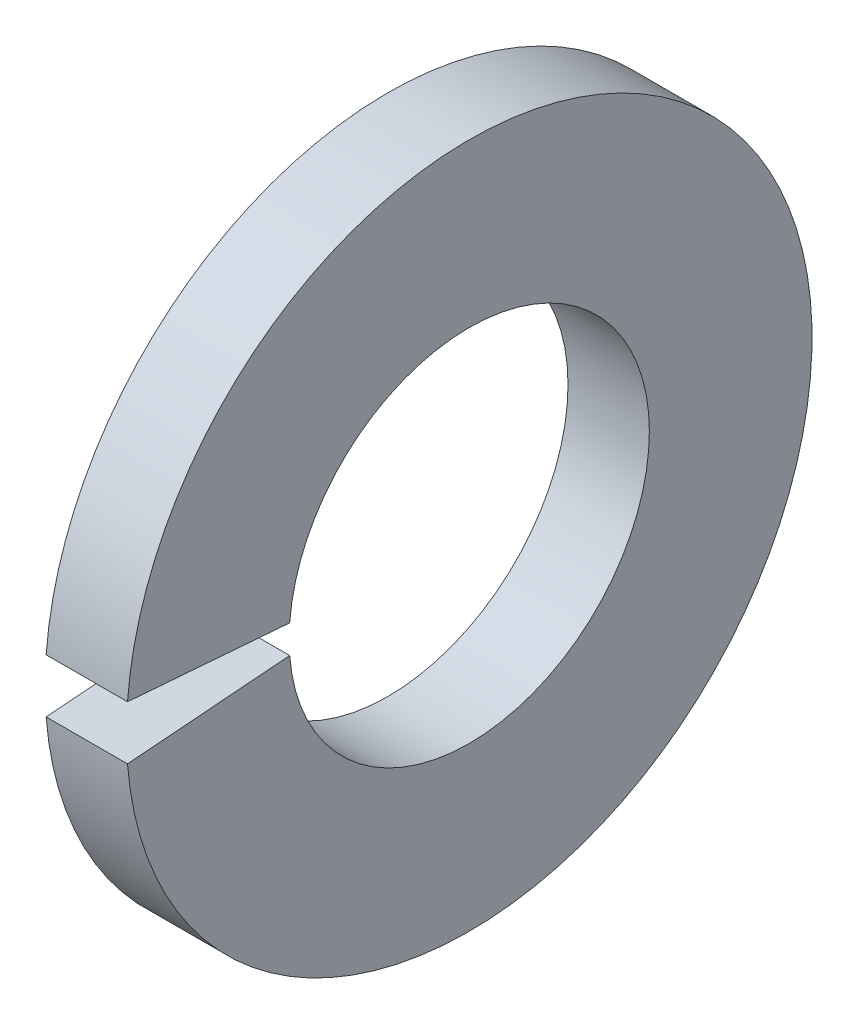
from build123d import *

# Parameters (mm, degrees)
SKETCH1_W = 0.7
SKETCH1_H = 1.4
GAP_DEPTH = 5.23024822


with BuildPart() as part:
    # Sketch1 → Base-Revolve (revolve)
    with BuildSketch(Plane.XY, mode=Mode.PRIVATE) as base_revolve_sk:
        with Locations((-0.35, 2.25)):
            Rectangle(SKETCH1_W, SKETCH1_H)
    revolve(base_revolve_sk.sketch.rotate(Axis((-34.925, 0, 0), (1, 0, 0)), 90), axis=Axis((-34.925, 0, 0), (1, 0, 0)))

    # Sketch2 → Gap (cut, through all)
    with BuildSketch(Plane(origin=(0, 0, 0), x_dir=(0, -1, 0), z_dir=(-1, 0, 0))):
        with BuildLine():
            Line((0, 0), (0.236083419, 2.999724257))
            ThreePointArc((0.236083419, 2.999724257), (0, 3.009), (-0.236083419, 2.999724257))
            Line((-0.236083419, 2.999724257), (0, 0))
        make_face()
    extrude(amount=GAP_DEPTH, mode=Mode.SUBTRACT)


solid = part.part
